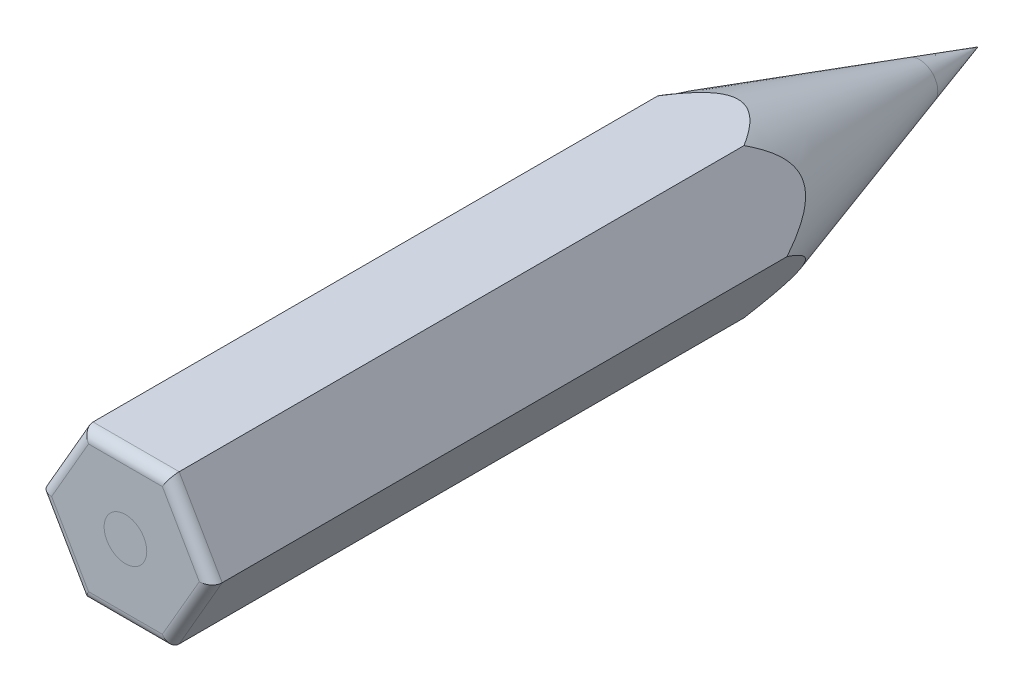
ISO-10303-21;
HEADER;
FILE_DESCRIPTION(('STEP AP214'),'2;1');
FILE_NAME('part.step','',(''),(''),'','','');
FILE_SCHEMA(('AUTOMOTIVE_DESIGN { 1 0 10303 214 1 1 1 1 }'));
ENDSEC;
DATA;
#1=APPLICATION_CONTEXT('core data for automotive mechanical design processes');
#2=APPLICATION_PROTOCOL_DEFINITION('international standard','automotive_design',2000,#1);
#3=PRODUCT_CONTEXT('',#1,'mechanical');
#4=PRODUCT('Part','Part','',(#3));
#5=PRODUCT_RELATED_PRODUCT_CATEGORY('part','',(#4));
#6=PRODUCT_DEFINITION_FORMATION('','',#4);
#7=PRODUCT_DEFINITION_CONTEXT('part definition',#1,'design');
#8=PRODUCT_DEFINITION('design','',#6,#7);
#9=PRODUCT_DEFINITION_SHAPE('','',#8);
#10=(LENGTH_UNIT() NAMED_UNIT(*) SI_UNIT(.MILLI.,.METRE.));
#11=(NAMED_UNIT(*) PLANE_ANGLE_UNIT() SI_UNIT($,.RADIAN.));
#12=(NAMED_UNIT(*) SI_UNIT($,.STERADIAN.) SOLID_ANGLE_UNIT());
#13=UNCERTAINTY_MEASURE_WITH_UNIT(LENGTH_MEASURE(1.E-05),#10,'distance_accuracy_value','');
#14=(GEOMETRIC_REPRESENTATION_CONTEXT(3) GLOBAL_UNCERTAINTY_ASSIGNED_CONTEXT((#13)) GLOBAL_UNIT_ASSIGNED_CONTEXT((#10,
#11,#12)) REPRESENTATION_CONTEXT('',''));
#15=CARTESIAN_POINT('',(0.,0.,0.));
#16=DIRECTION('',(0.,0.,1.));
#17=DIRECTION('',(1.,0.,0.));
#18=AXIS2_PLACEMENT_3D('',#15,#16,#17);
#19=CARTESIAN_POINT('',(0.,0.,0.));
#20=DIRECTION('',(0.,0.,1.));
#21=DIRECTION('',(1.,0.,0.));
#22=AXIS2_PLACEMENT_3D('',#19,#20,#21);
#23=CONICAL_SURFACE('',#22,0.,0.301409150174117);
#24=CARTESIAN_POINT('',(0.,0.,0.));
#25=VERTEX_POINT('',#24);
#26=VERTEX_LOOP('',#25);
#27=FACE_BOUND('',#26,.T.);
#28=CARTESIAN_POINT('',(0.,0.,2.73816623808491));
#29=DIRECTION('',(0.,0.,1.));
#30=DIRECTION('',(1.,0.,0.));
#31=AXIS2_PLACEMENT_3D('',#28,#29,#30);
#32=CIRCLE('',#31,0.85124362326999);
#33=CARTESIAN_POINT('',(0.85124362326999,0.,2.73816623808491));
#34=VERTEX_POINT('',#33);
#35=EDGE_CURVE('E158',#34,#34,#32,.T.);
#36=ORIENTED_EDGE('',*,*,#35,.F.);
#37=EDGE_LOOP('',(#36));
#38=FACE_BOUND('',#37,.T.);
#39=ADVANCED_FACE('F78',(#27,#38),#23,.T.);
#40=CARTESIAN_POINT('',(0.,0.,40.));
#41=DIRECTION('',(0.,0.,1.));
#42=DIRECTION('',(1.,0.,0.));
#43=AXIS2_PLACEMENT_3D('',#40,#41,#42);
#44=PLANE('',#43);
#45=DIRECTION('',(0.500000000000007,-0.866025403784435,0.));
#46=VECTOR('',#45,1.);
#47=CARTESIAN_POINT('',(-1.58771324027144,-3.25000000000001,40.));
#48=LINE('',#47,#46);
#49=CARTESIAN_POINT('',(-3.46410161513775,0.,40.));
#50=VERTEX_POINT('',#49);
#51=CARTESIAN_POINT('',(-1.73205080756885,-3.00000000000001,40.));
#52=VERTEX_POINT('',#51);
#53=EDGE_CURVE('E179',#50,#52,#48,.T.);
#54=ORIENTED_EDGE('',*,*,#53,.T.);
#55=DIRECTION('',(1.,0.,0.));
#56=VECTOR('',#55,1.);
#57=CARTESIAN_POINT('',(2.02072594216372,-2.99999999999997,40.));
#58=LINE('',#57,#56);
#59=CARTESIAN_POINT('',(1.73205080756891,-2.99999999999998,40.));
#60=VERTEX_POINT('',#59);
#61=EDGE_CURVE('E181',#52,#60,#58,.T.);
#62=ORIENTED_EDGE('',*,*,#61,.T.);
#63=DIRECTION('',(0.499999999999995,0.866025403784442,0.));
#64=VECTOR('',#63,1.);
#65=CARTESIAN_POINT('',(3.60843918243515,0.249999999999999,40.));
#66=LINE('',#65,#64);
#67=CARTESIAN_POINT('',(3.46410161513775,0.,40.));
#68=VERTEX_POINT('',#67);
#69=EDGE_CURVE('E161',#60,#68,#66,.T.);
#70=ORIENTED_EDGE('',*,*,#69,.T.);
#71=DIRECTION('',(-0.500000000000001,0.866025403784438,0.));
#72=VECTOR('',#71,1.);
#73=CARTESIAN_POINT('',(1.58771324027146,3.25,40.));
#74=LINE('',#73,#72);
#75=CARTESIAN_POINT('',(1.73205080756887,3.,40.));
#76=VERTEX_POINT('',#75);
#77=EDGE_CURVE('E167',#68,#76,#74,.T.);
#78=ORIENTED_EDGE('',*,*,#77,.T.);
#79=DIRECTION('',(-1.,0.,0.));
#80=VECTOR('',#79,1.);
#81=CARTESIAN_POINT('',(-2.0207259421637,2.99999999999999,40.));
#82=LINE('',#81,#80);
#83=CARTESIAN_POINT('',(-1.73205080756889,2.99999999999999,40.));
#84=VERTEX_POINT('',#83);
#85=EDGE_CURVE('E175',#76,#84,#82,.T.);
#86=ORIENTED_EDGE('',*,*,#85,.T.);
#87=DIRECTION('',(-0.499999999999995,-0.866025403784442,0.));
#88=VECTOR('',#87,1.);
#89=CARTESIAN_POINT('',(-3.60843918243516,-0.250000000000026,40.));
#90=LINE('',#89,#88);
#91=EDGE_CURVE('E177',#84,#50,#90,.T.);
#92=ORIENTED_EDGE('',*,*,#91,.T.);
#93=EDGE_LOOP('',(#54,#62,#70,#78,#86,#92));
#94=FACE_BOUND('',#93,.T.);
#95=CARTESIAN_POINT('',(0.,0.,40.));
#96=DIRECTION('',(0.,0.,1.));
#97=DIRECTION('',(1.,0.,0.));
#98=AXIS2_PLACEMENT_3D('',#95,#96,#97);
#99=CIRCLE('',#98,1.);
#100=CARTESIAN_POINT('',(1.,0.,40.));
#101=VERTEX_POINT('',#100);
#102=EDGE_CURVE('E162',#101,#101,#99,.F.);
#103=ORIENTED_EDGE('',*,*,#102,.T.);
#104=EDGE_LOOP('',(#103));
#105=FACE_BOUND('',#104,.T.);
#106=ADVANCED_FACE('F153',(#94,#105),#44,.T.);
#107=ORIENTED_EDGE('',*,*,#35,.T.);
#108=EDGE_LOOP('',(#107));
#109=FACE_BOUND('',#108,.T.);
#110=CARTESIAN_POINT('',(2.02061047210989,-3.50019999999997,13.0003714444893));
#111=CARTESIAN_POINT('',(2.03722946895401,-3.47141505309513,12.9469145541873));
#112=CARTESIAN_POINT('',(2.05406732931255,-3.44225102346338,12.8937306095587));
#113=CARTESIAN_POINT('',(2.0882417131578,-3.38305925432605,12.7879937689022));
#114=CARTESIAN_POINT('',(2.10557833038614,-3.35303135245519,12.7354409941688));
#115=CARTESIAN_POINT('',(2.15859521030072,-3.26120342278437,12.5783630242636));
#116=CARTESIAN_POINT('',(2.19511665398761,-3.1979464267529,12.4749574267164));
#117=CARTESIAN_POINT('',(2.27180037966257,-3.0651263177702,12.2702621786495));
#118=CARTESIAN_POINT('',(2.31202281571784,-2.99545901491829,12.1690619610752));
#119=CARTESIAN_POINT('',(2.39629081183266,-2.84950256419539,11.9734651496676));
#120=CARTESIAN_POINT('',(2.44032735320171,-2.77322903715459,11.8790534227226));
#121=CARTESIAN_POINT('',(2.51820192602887,-2.63834632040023,11.73032605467));
#122=CARTESIAN_POINT('',(2.55061417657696,-2.58220665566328,11.6730550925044));
#123=CARTESIAN_POINT('',(2.61822535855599,-2.4651006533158,11.565482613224));
#124=CARTESIAN_POINT('',(2.65342202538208,-2.40413823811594,11.5151755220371));
#125=CARTESIAN_POINT('',(2.72759365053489,-2.27566921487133,11.4239429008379));
#126=CARTESIAN_POINT('',(2.76661944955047,-2.20807454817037,11.3831778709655));
#127=CARTESIAN_POINT('',(2.84778395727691,-2.06749349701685,11.3170053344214));
#128=CARTESIAN_POINT('',(2.88990925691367,-1.99453033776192,11.2915355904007));
#129=CARTESIAN_POINT('',(2.96390554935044,-1.86636499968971,11.2648600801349));
#130=CARTESIAN_POINT('',(2.99534266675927,-1.81191431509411,11.258855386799));
#131=CARTESIAN_POINT('',(3.05827045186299,-1.7029201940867,11.25787252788));
#132=CARTESIAN_POINT('',(3.08976112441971,-1.64837674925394,11.2628954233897));
#133=CARTESIAN_POINT('',(3.15172794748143,-1.5410470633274,11.2832954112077));
#134=CARTESIAN_POINT('',(3.18220779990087,-1.48825441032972,11.2986289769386));
#135=CARTESIAN_POINT('',(3.2416996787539,-1.38521145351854,11.3379679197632));
#136=CARTESIAN_POINT('',(3.27071132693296,-1.33496180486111,11.3619755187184));
#137=CARTESIAN_POINT('',(3.34786894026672,-1.20132089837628,11.4370428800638));
#138=CARTESIAN_POINT('',(3.39432200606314,-1.12086182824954,11.4949869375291));
#139=CARTESIAN_POINT('',(3.48283944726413,-0.967545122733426,11.6240455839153));
#140=CARTESIAN_POINT('',(3.52485596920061,-0.894770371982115,11.6952845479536));
#141=CARTESIAN_POINT('',(3.61345862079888,-0.741306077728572,11.8616096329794));
#142=CARTESIAN_POINT('',(3.65915419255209,-0.662159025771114,11.95856329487));
#143=CARTESIAN_POINT('',(3.74645213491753,-0.510954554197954,12.1598244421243));
#144=CARTESIAN_POINT('',(3.78804383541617,-0.438915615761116,12.2641499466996));
#145=CARTESIAN_POINT('',(3.86621004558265,-0.303527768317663,12.472577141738));
#146=CARTESIAN_POINT('',(3.90292760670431,-0.23993108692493,12.5764662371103));
#147=CARTESIAN_POINT('',(3.95621180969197,-0.147640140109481,12.7342710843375));
#148=CARTESIAN_POINT('',(3.97362910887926,-0.117472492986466,12.7870535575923));
#149=CARTESIAN_POINT('',(4.00796025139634,-0.058009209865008,12.8932562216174));
#150=CARTESIAN_POINT('',(4.0248741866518,-0.0287134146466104,12.9466762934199));
#151=CARTESIAN_POINT('',(4.04156735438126,0.000200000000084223,13.0003714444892));
#152=B_SPLINE_CURVE_WITH_KNOTS('',3,(#110,#111,#112,#113,#114,#115,#116,#117,#118,#119,#120,
#121,#122,#123,#124,#125,#126,#127,#128,#129,#130,#131,#132,#133,#134,#135,#136,#137,#138,#139,
#140,#141,#142,#143,#144,#145,#146,#147,#148,#149,#150,#151),.UNSPECIFIED.,.F.,.F.,(4,2,2,2,2,2,
2,2,2,2,2,2,2,2,2,2,2,2,2,2,4),(0.,0.188837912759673,0.377711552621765,0.757356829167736,
1.14493911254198,1.53162872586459,1.79079874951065,2.04976011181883,2.3128062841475,
2.57477472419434,2.76334374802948,2.95193091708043,3.13972692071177,3.32757106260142,
3.65414724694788,3.98394746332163,4.38293624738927,4.78293648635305,5.16444572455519,
5.35416083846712,5.54384109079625),.UNSPECIFIED.);
#153=CARTESIAN_POINT('',(2.02072594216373,-3.49999999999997,13.));
#154=VERTEX_POINT('',#153);
#155=CARTESIAN_POINT('',(4.04145188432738,0.,13.));
#156=VERTEX_POINT('',#155);
#157=EDGE_CURVE('E242',#154,#156,#152,.T.);
#158=ORIENTED_EDGE('',*,*,#157,.F.);
#159=CARTESIAN_POINT('',(-12.326890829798,-3.50000000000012,41.2188124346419));
#160=CARTESIAN_POINT('',(-12.0741858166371,-3.50000000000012,40.4368939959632));
#161=CARTESIAN_POINT('',(-11.8209783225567,-3.50000000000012,39.6551374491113));
#162=CARTESIAN_POINT('',(-11.313288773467,-3.50000000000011,38.0920348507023));
#163=CARTESIAN_POINT('',(-11.0588067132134,-3.50000000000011,37.3106888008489));
#164=CARTESIAN_POINT('',(-10.5482451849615,-3.5000000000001,35.7483310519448));
#165=CARTESIAN_POINT('',(-10.2921653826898,-3.5000000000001,34.9673194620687));
#166=CARTESIAN_POINT('',(-9.77808417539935,-3.5000000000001,33.4059303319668));
#167=CARTESIAN_POINT('',(-9.52008277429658,-3.50000000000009,32.6255527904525));
#168=CARTESIAN_POINT('',(-9.0006166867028,-3.50000000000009,31.0625052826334));
#169=CARTESIAN_POINT('',(-8.73914231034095,-3.50000000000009,30.2798385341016));
#170=CARTESIAN_POINT('',(-8.21301658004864,-3.50000000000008,28.7155738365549));
#171=CARTESIAN_POINT('',(-7.94836523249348,-3.50000000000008,27.9339758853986));
#172=CARTESIAN_POINT('',(-7.41485804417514,-3.50000000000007,26.3723200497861));
#173=CARTESIAN_POINT('',(-7.14600271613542,-3.50000000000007,25.5922619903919));
#174=CARTESIAN_POINT('',(-6.60247055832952,-3.50000000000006,24.0341797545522));
#175=CARTESIAN_POINT('',(-6.32779380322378,-3.50000000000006,23.2561555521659));
#176=CARTESIAN_POINT('',(-5.83773374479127,-3.50000000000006,21.8917707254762));
#177=CARTESIAN_POINT('',(-5.6241556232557,-3.50000000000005,21.3047625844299));
#178=CARTESIAN_POINT('',(-5.19028824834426,-3.50000000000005,20.1331091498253));
#179=CARTESIAN_POINT('',(-4.96999792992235,-3.50000000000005,19.5484642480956));
#180=CARTESIAN_POINT('',(-4.63233695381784,-3.50000000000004,18.6744391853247));
#181=CARTESIAN_POINT('',(-4.51860577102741,-3.50000000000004,18.3836537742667));
#182=CARTESIAN_POINT('',(-4.28813108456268,-3.50000000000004,17.8032807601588));
#183=CARTESIAN_POINT('',(-4.17138762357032,-3.50000000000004,17.5136931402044));
#184=CARTESIAN_POINT('',(-3.93415637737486,-3.50000000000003,16.9361582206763));
#185=CARTESIAN_POINT('',(-3.8136697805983,-3.50000000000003,16.6482104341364));
#186=CARTESIAN_POINT('',(-3.56783386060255,-3.50000000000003,16.0744036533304));
#187=CARTESIAN_POINT('',(-3.44248478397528,-3.50000000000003,15.7885445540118));
#188=CARTESIAN_POINT('',(-3.20129524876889,-3.50000000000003,15.2551426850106));
#189=CARTESIAN_POINT('',(-3.08621247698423,-3.50000000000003,15.007258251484));
#190=CARTESIAN_POINT('',(-2.84936836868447,-3.50000000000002,14.5145005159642));
#191=CARTESIAN_POINT('',(-2.72760349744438,-3.50000000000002,14.2696288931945));
#192=CARTESIAN_POINT('',(-2.5378893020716,-3.50000000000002,13.9056453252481));
#193=CARTESIAN_POINT('',(-2.47339482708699,-3.50000000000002,13.7847337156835));
#194=CARTESIAN_POINT('',(-2.34159407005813,-3.50000000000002,13.5444567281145));
#195=CARTESIAN_POINT('',(-2.27428798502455,-3.50000000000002,13.4250912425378));
#196=CARTESIAN_POINT('',(-2.13629519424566,-3.50000000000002,13.1884677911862));
#197=CARTESIAN_POINT('',(-2.06561162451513,-3.50000000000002,13.0712080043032));
#198=CARTESIAN_POINT('',(-1.91996345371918,-3.50000000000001,12.8393910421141));
#199=CARTESIAN_POINT('',(-1.84499983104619,-3.50000000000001,12.7248332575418));
#200=CARTESIAN_POINT('',(-1.70388794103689,-3.50000000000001,12.5202433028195));
#201=CARTESIAN_POINT('',(-1.6386590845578,-3.50000000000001,12.4295801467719));
#202=CARTESIAN_POINT('',(-1.50356958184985,-3.50000000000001,12.2516180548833));
#203=CARTESIAN_POINT('',(-1.43370520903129,-3.50000000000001,12.1643219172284));
#204=CARTESIAN_POINT('',(-1.28862724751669,-3.50000000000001,11.995192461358));
#205=CARTESIAN_POINT('',(-1.2134500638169,-3.50000000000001,11.9133282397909));
#206=CARTESIAN_POINT('',(-1.05585086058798,-3.5,11.7569887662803));
#207=CARTESIAN_POINT('',(-0.973442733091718,-3.5,11.6824999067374));
#208=CARTESIAN_POINT('',(-0.823883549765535,-3.5,11.5644053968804));
#209=CARTESIAN_POINT('',(-0.75896496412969,-3.5,11.5180077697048));
#210=CARTESIAN_POINT('',(-0.623717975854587,-3.5,11.433711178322));
#211=CARTESIAN_POINT('',(-0.553392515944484,-3.5,11.3958076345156));
#212=CARTESIAN_POINT('',(-0.418337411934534,-3.5,11.3367446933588));
#213=CARTESIAN_POINT('',(-0.354348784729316,-3.5,11.313927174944));
#214=CARTESIAN_POINT('',(-0.223470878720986,-3.5,11.2793149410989));
#215=CARTESIAN_POINT('',(-0.156586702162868,-3.5,11.2675016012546));
#216=CARTESIAN_POINT('',(-0.0213573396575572,-3.49999999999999,11.2564329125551));
#217=CARTESIAN_POINT('',(0.0469940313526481,-3.49999999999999,11.2572500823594));
#218=CARTESIAN_POINT('',(0.182388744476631,-3.49999999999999,11.2714964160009));
#219=CARTESIAN_POINT('',(0.249430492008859,-3.49999999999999,11.2849400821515));
#220=CARTESIAN_POINT('',(0.394296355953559,-3.49999999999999,11.3266844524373));
#221=CARTESIAN_POINT('',(0.471364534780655,-3.49999999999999,11.3575453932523));
#222=CARTESIAN_POINT('',(0.619654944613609,-3.49999999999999,11.4309649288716));
#223=CARTESIAN_POINT('',(0.690865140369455,-3.49999999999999,11.4735468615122));
#224=CARTESIAN_POINT('',(0.82210484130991,-3.49999999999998,11.5630466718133));
#225=CARTESIAN_POINT('',(0.882572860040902,-3.49999999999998,11.6093368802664));
#226=CARTESIAN_POINT('',(0.999391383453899,-3.49999999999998,11.7068951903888));
#227=CARTESIAN_POINT('',(1.05573792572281,-3.49999999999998,11.7581679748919));
#228=CARTESIAN_POINT('',(1.1650688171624,-3.49999999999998,11.8645101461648));
#229=CARTESIAN_POINT('',(1.21804083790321,-3.49999999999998,11.9195920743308));
#230=CARTESIAN_POINT('',(1.32094040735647,-3.49999999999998,12.0324594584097));
#231=CARTESIAN_POINT('',(1.37086937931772,-3.49999999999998,12.0902436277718));
#232=CARTESIAN_POINT('',(1.51182796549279,-3.49999999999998,12.2606329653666));
#233=CARTESIAN_POINT('',(1.59957795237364,-3.49999999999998,12.3759455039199));
#234=CARTESIAN_POINT('',(1.76838927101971,-3.49999999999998,12.6113998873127));
#235=CARTESIAN_POINT('',(1.84944562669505,-3.49999999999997,12.7315452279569));
#236=CARTESIAN_POINT('',(2.0065755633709,-3.49999999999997,12.9754108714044));
#237=CARTESIAN_POINT('',(2.08263766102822,-3.49999999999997,13.0991385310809));
#238=CARTESIAN_POINT('',(2.23070583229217,-3.49999999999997,13.3490011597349));
#239=CARTESIAN_POINT('',(2.30271140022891,-3.49999999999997,13.4751364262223));
#240=CARTESIAN_POINT('',(2.44411165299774,-3.49999999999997,13.7303892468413));
#241=CARTESIAN_POINT('',(2.51347584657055,-3.49999999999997,13.859523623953));
#242=CARTESIAN_POINT('',(2.64948877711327,-3.49999999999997,14.1192202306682));
#243=CARTESIAN_POINT('',(2.7161373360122,-3.49999999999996,14.249782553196));
#244=CARTESIAN_POINT('',(2.84707039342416,-3.49999999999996,14.5118291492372));
#245=CARTESIAN_POINT('',(2.91135842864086,-3.49999999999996,14.6433116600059));
#246=CARTESIAN_POINT('',(3.03802698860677,-3.49999999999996,14.9071846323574));
#247=CARTESIAN_POINT('',(3.10040757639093,-3.49999999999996,15.0395750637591));
#248=CARTESIAN_POINT('',(3.28759879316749,-3.49999999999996,15.4432051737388));
#249=CARTESIAN_POINT('',(3.4098538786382,-3.49999999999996,15.7156303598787));
#250=CARTESIAN_POINT('',(3.64935035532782,-3.49999999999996,16.2626814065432));
#251=CARTESIAN_POINT('',(3.76659140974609,-3.49999999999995,16.5373074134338));
#252=CARTESIAN_POINT('',(3.99720537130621,-3.49999999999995,17.08824349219));
#253=CARTESIAN_POINT('',(4.11057745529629,-3.49999999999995,17.3645539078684));
#254=CARTESIAN_POINT('',(4.33422513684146,-3.49999999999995,17.9184269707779));
#255=CARTESIAN_POINT('',(4.44450067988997,-3.49999999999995,18.195989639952));
#256=CARTESIAN_POINT('',(4.771947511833,-3.49999999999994,19.0310437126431));
#257=CARTESIAN_POINT('',(4.9853688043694,-3.49999999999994,19.5900046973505));
#258=CARTESIAN_POINT('',(5.40532707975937,-3.49999999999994,20.7104096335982));
#259=CARTESIAN_POINT('',(5.61186491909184,-3.49999999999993,21.2718532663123));
#260=CARTESIAN_POINT('',(6.00468298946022,-3.49999999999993,22.3544983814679));
#261=CARTESIAN_POINT('',(6.19132310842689,-3.49999999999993,22.8755695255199));
#262=CARTESIAN_POINT('',(6.56132150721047,-3.49999999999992,23.9188968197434));
#263=CARTESIAN_POINT('',(6.74467965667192,-3.49999999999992,24.4411530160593));
#264=CARTESIAN_POINT('',(7.10830865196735,-3.49999999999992,25.4851149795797));
#265=CARTESIAN_POINT('',(7.28858664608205,-3.49999999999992,26.0068182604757));
#266=CARTESIAN_POINT('',(7.64704281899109,-3.49999999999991,27.0509140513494));
#267=CARTESIAN_POINT('',(7.82522111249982,-3.49999999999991,27.5733065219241));
#268=CARTESIAN_POINT('',(8.00259369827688,-3.49999999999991,28.0959701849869));
#269=B_SPLINE_CURVE_WITH_KNOTS('',3,(#159,#160,#161,#162,#163,#164,#165,#166,#167,#168,#169,
#170,#171,#172,#173,#174,#175,#176,#177,#178,#179,#180,#181,#182,#183,#184,#185,#186,#187,#188,
#189,#190,#191,#192,#193,#194,#195,#196,#197,#198,#199,#200,#201,#202,#203,#204,#205,#206,#207,
#208,#209,#210,#211,#212,#213,#214,#215,#216,#217,#218,#219,#220,#221,#222,#223,#224,#225,#226,
#227,#228,#229,#230,#231,#232,#233,#234,#235,#236,#237,#238,#239,#240,#241,#242,#243,#244,#245,
#246,#247,#248,#249,#250,#251,#252,#253,#254,#255,#256,#257,#258,#259,#260,#261,#262,#263,#264,
#265,#266,#267,#268),.UNSPECIFIED.,.F.,.F.,(4,2,2,2,2,2,2,2,2,2,2,2,2,2,2,2,2,2,2,2,2,2,2,2,2,2,
2,2,2,2,2,2,2,2,2,2,2,2,2,2,2,2,2,2,2,2,2,2,2,2,2,2,2,2,4),(0.,2.46521989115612,
4.93044993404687,7.39621430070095,9.86197364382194,12.3375341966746,14.8130897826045,
17.2883457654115,19.7635700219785,21.637511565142,23.5117520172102,24.4484456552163,
25.3851260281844,26.3215119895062,27.2578505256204,28.077676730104,28.8979408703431,
29.3090236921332,29.720077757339,30.1307573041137,30.5413433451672,30.8763057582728,
31.2115407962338,31.5446675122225,31.8771676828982,32.1160997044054,32.3549025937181,
32.5579148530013,32.7605828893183,32.9644149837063,33.1684814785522,33.4161397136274,
33.6642946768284,33.8924137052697,34.1207492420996,34.349876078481,34.5788949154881,
35.0132188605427,35.4478628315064,35.8834735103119,36.3191383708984,36.7588529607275,
37.198596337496,37.6376514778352,38.0766920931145,38.9724128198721,39.8681936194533,
40.7641638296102,41.6601498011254,43.4550309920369,45.2496880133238,46.9101394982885,
48.5706567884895,50.2265717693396,51.8823958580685),.UNSPECIFIED.);
#270=CARTESIAN_POINT('',(-2.02072594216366,-3.50000000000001,13.));
#271=VERTEX_POINT('',#270);
#272=EDGE_CURVE('E170',#271,#154,#269,.T.);
#273=ORIENTED_EDGE('',*,*,#272,.F.);
#274=CARTESIAN_POINT('',(-4.04156735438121,0.000199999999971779,13.0003714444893));
#275=CARTESIAN_POINT('',(-4.02494835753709,-0.0285849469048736,12.9469145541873));
#276=CARTESIAN_POINT('',(-4.00811049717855,-0.0577489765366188,12.8937306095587));
#277=CARTESIAN_POINT('',(-3.9739361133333,-0.116940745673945,12.7879937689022));
#278=CARTESIAN_POINT('',(-3.95659949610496,-0.146968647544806,12.7354409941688));
#279=CARTESIAN_POINT('',(-3.90358261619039,-0.238796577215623,12.5783630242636));
#280=CARTESIAN_POINT('',(-3.86706117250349,-0.302053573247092,12.4749574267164));
#281=CARTESIAN_POINT('',(-3.79037744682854,-0.434873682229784,12.2702621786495));
#282=CARTESIAN_POINT('',(-3.75015501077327,-0.504540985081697,12.1690619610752));
#283=CARTESIAN_POINT('',(-3.66588701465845,-0.650497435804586,11.9734651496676));
#284=CARTESIAN_POINT('',(-3.6218504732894,-0.726770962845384,11.8790534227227));
#285=CARTESIAN_POINT('',(-3.54397590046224,-0.861653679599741,11.73032605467));
#286=CARTESIAN_POINT('',(-3.51156364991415,-0.91779334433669,11.6730550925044));
#287=CARTESIAN_POINT('',(-3.44395246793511,-1.03489934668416,11.565482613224));
#288=CARTESIAN_POINT('',(-3.40875580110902,-1.09586176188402,11.5151755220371));
#289=CARTESIAN_POINT('',(-3.33458417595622,-1.22433078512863,11.4239429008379));
#290=CARTESIAN_POINT('',(-3.29555837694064,-1.29192545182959,11.3831778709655));
#291=CARTESIAN_POINT('',(-3.21439386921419,-1.4325065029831,11.3170053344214));
#292=CARTESIAN_POINT('',(-3.17226856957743,-1.50546966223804,11.2915355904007));
#293=CARTESIAN_POINT('',(-3.09827227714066,-1.63363500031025,11.2648600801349));
#294=CARTESIAN_POINT('',(-3.06683515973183,-1.68808568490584,11.2588553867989));
#295=CARTESIAN_POINT('',(-3.00390737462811,-1.79707980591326,11.25787252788));
#296=CARTESIAN_POINT('',(-2.97241670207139,-1.85162325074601,11.2628954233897));
#297=CARTESIAN_POINT('',(-2.91044987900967,-1.95895293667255,11.2832954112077));
#298=CARTESIAN_POINT('',(-2.87997002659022,-2.01174558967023,11.2986289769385));
#299=CARTESIAN_POINT('',(-2.82047814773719,-2.11478854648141,11.3379679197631));
#300=CARTESIAN_POINT('',(-2.79146649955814,-2.16503819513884,11.3619755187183));
#301=CARTESIAN_POINT('',(-2.71430888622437,-2.29867910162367,11.4370428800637));
#302=CARTESIAN_POINT('',(-2.66785582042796,-2.3791381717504,11.494986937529));
#303=CARTESIAN_POINT('',(-2.57933837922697,-2.53245487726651,11.6240455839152));
#304=CARTESIAN_POINT('',(-2.53732185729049,-2.60522962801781,11.6952845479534));
#305=CARTESIAN_POINT('',(-2.44871920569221,-2.75869392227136,11.8616096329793));
#306=CARTESIAN_POINT('',(-2.403023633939,-2.83784097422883,11.9585632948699));
#307=CARTESIAN_POINT('',(-2.31572569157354,-2.98904544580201,12.1598244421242));
#308=CARTESIAN_POINT('',(-2.27413399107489,-3.06108438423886,12.2641499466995));
#309=CARTESIAN_POINT('',(-2.1959677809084,-3.19647223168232,12.472577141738));
#310=CARTESIAN_POINT('',(-2.15925021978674,-3.26006891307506,12.5764662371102));
#311=CARTESIAN_POINT('',(-2.10596601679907,-3.35235985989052,12.7342710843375));
#312=CARTESIAN_POINT('',(-2.08854871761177,-3.38252750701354,12.7870535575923));
#313=CARTESIAN_POINT('',(-2.0542175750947,-3.44199079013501,12.8932562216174));
#314=CARTESIAN_POINT('',(-2.03730363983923,-3.4712865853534,12.9466762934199));
#315=CARTESIAN_POINT('',(-2.02061047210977,-3.5002000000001,13.0003714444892));
#316=B_SPLINE_CURVE_WITH_KNOTS('',3,(#274,#275,#276,#277,#278,#279,#280,#281,#282,#283,#284,
#285,#286,#287,#288,#289,#290,#291,#292,#293,#294,#295,#296,#297,#298,#299,#300,#301,#302,#303,
#304,#305,#306,#307,#308,#309,#310,#311,#312,#313,#314,#315),.UNSPECIFIED.,.F.,.F.,(4,2,2,2,2,2,
2,2,2,2,2,2,2,2,2,2,2,2,2,2,4),(0.,0.188837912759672,0.377711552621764,0.757356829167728,
1.14493911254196,1.53162872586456,1.79079874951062,2.04976011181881,2.31280628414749,
2.57477472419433,2.76334374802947,2.95193091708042,3.13972692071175,3.3275710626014,
3.65414724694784,3.98394746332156,4.38293624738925,4.78293648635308,5.16444572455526,
5.3541608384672,5.54384109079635),.UNSPECIFIED.);
#317=CARTESIAN_POINT('',(-4.04145188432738,0.,13.));
#318=VERTEX_POINT('',#317);
#319=EDGE_CURVE('E208',#318,#271,#316,.T.);
#320=ORIENTED_EDGE('',*,*,#319,.F.);
#321=CARTESIAN_POINT('',(-2.02061047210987,3.50019999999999,13.0003714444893));
#322=CARTESIAN_POINT('',(-2.03722946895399,3.47141505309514,12.9469145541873));
#323=CARTESIAN_POINT('',(-2.05406732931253,3.4422510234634,12.8937306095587));
#324=CARTESIAN_POINT('',(-2.08824171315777,3.38305925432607,12.7879937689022));
#325=CARTESIAN_POINT('',(-2.10557833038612,3.35303135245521,12.7354409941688));
#326=CARTESIAN_POINT('',(-2.15859521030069,3.26120342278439,12.5783630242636));
#327=CARTESIAN_POINT('',(-2.19511665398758,3.19794642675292,12.4749574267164));
#328=CARTESIAN_POINT('',(-2.27180037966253,3.06512631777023,12.2702621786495));
#329=CARTESIAN_POINT('',(-2.3120228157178,2.99545901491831,12.1690619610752));
#330=CARTESIAN_POINT('',(-2.39629081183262,2.84950256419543,11.9734651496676));
#331=CARTESIAN_POINT('',(-2.44032735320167,2.77322903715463,11.8790534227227));
#332=CARTESIAN_POINT('',(-2.51820192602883,2.63834632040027,11.73032605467));
#333=CARTESIAN_POINT('',(-2.55061417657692,2.58220665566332,11.6730550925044));
#334=CARTESIAN_POINT('',(-2.61822535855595,2.46510065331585,11.565482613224));
#335=CARTESIAN_POINT('',(-2.65342202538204,2.40413823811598,11.5151755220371));
#336=CARTESIAN_POINT('',(-2.72759365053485,2.27566921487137,11.4239429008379));
#337=CARTESIAN_POINT('',(-2.76661944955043,2.20807454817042,11.3831778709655));
#338=CARTESIAN_POINT('',(-2.84778395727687,2.0674934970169,11.3170053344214));
#339=CARTESIAN_POINT('',(-2.88990925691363,1.99453033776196,11.2915355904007));
#340=CARTESIAN_POINT('',(-2.9639055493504,1.86636499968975,11.2648600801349));
#341=CARTESIAN_POINT('',(-2.99534266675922,1.81191431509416,11.2588553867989));
#342=CARTESIAN_POINT('',(-3.05827045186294,1.70292019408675,11.25787252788));
#343=CARTESIAN_POINT('',(-3.08976112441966,1.64837674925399,11.2628954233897));
#344=CARTESIAN_POINT('',(-3.15172794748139,1.54104706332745,11.2832954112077));
#345=CARTESIAN_POINT('',(-3.18220779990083,1.48825441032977,11.2986289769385));
#346=CARTESIAN_POINT('',(-3.24169967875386,1.38521145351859,11.3379679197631));
#347=CARTESIAN_POINT('',(-3.27071132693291,1.33496180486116,11.3619755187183));
#348=CARTESIAN_POINT('',(-3.34786894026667,1.20132089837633,11.4370428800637));
#349=CARTESIAN_POINT('',(-3.39432200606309,1.12086182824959,11.494986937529));
#350=CARTESIAN_POINT('',(-3.48283944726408,0.967545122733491,11.6240455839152));
#351=CARTESIAN_POINT('',(-3.52485596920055,0.894770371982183,11.6952845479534));
#352=CARTESIAN_POINT('',(-3.61345862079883,0.741306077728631,11.8616096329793));
#353=CARTESIAN_POINT('',(-3.65915419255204,0.662159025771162,11.9585632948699));
#354=CARTESIAN_POINT('',(-3.74645213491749,0.510954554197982,12.1598244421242));
#355=CARTESIAN_POINT('',(-3.78804383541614,0.438915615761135,12.2641499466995));
#356=CARTESIAN_POINT('',(-3.86621004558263,0.303527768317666,12.472577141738));
#357=CARTESIAN_POINT('',(-3.9029276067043,0.239931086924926,12.5764662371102));
#358=CARTESIAN_POINT('',(-3.95621180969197,0.147640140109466,12.7342710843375));
#359=CARTESIAN_POINT('',(-3.97362910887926,0.117472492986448,12.7870535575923));
#360=CARTESIAN_POINT('',(-4.00796025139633,0.058009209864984,12.8932562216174));
#361=CARTESIAN_POINT('',(-4.0248741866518,0.028713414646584,12.9466762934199));
#362=CARTESIAN_POINT('',(-4.04156735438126,-0.000200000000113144,13.0003714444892));
#363=B_SPLINE_CURVE_WITH_KNOTS('',3,(#321,#322,#323,#324,#325,#326,#327,#328,#329,#330,#331,
#332,#333,#334,#335,#336,#337,#338,#339,#340,#341,#342,#343,#344,#345,#346,#347,#348,#349,#350,
#351,#352,#353,#354,#355,#356,#357,#358,#359,#360,#361,#362),.UNSPECIFIED.,.F.,.F.,(4,2,2,2,2,2,
2,2,2,2,2,2,2,2,2,2,2,2,2,2,4),(0.,0.188837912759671,0.37771155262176,0.757356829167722,
1.14493911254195,1.53162872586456,1.79079874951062,2.04976011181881,2.31280628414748,
2.57477472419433,2.76334374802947,2.95193091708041,3.13972692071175,3.3275710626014,
3.65414724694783,3.98394746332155,4.38293624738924,4.78293648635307,5.16444572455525,
5.3541608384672,5.54384109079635),.UNSPECIFIED.);
#364=CARTESIAN_POINT('',(-2.0207259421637,3.49999999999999,13.));
#365=VERTEX_POINT('',#364);
#366=EDGE_CURVE('E214',#365,#318,#363,.T.);
#367=ORIENTED_EDGE('',*,*,#366,.F.);
#368=CARTESIAN_POINT('',(-12.326890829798,3.49999999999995,41.218812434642));
#369=CARTESIAN_POINT('',(-12.0741858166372,3.49999999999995,40.4368939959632));
#370=CARTESIAN_POINT('',(-11.8209783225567,3.49999999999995,39.6551374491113));
#371=CARTESIAN_POINT('',(-11.313288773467,3.49999999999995,38.0920348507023));
#372=CARTESIAN_POINT('',(-11.0588067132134,3.49999999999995,37.3106888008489));
#373=CARTESIAN_POINT('',(-10.5482451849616,3.49999999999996,35.7483310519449));
#374=CARTESIAN_POINT('',(-10.2921653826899,3.49999999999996,34.9673194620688));
#375=CARTESIAN_POINT('',(-9.77808417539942,3.49999999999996,33.4059303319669));
#376=CARTESIAN_POINT('',(-9.52008277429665,3.49999999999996,32.6255527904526));
#377=CARTESIAN_POINT('',(-9.00061668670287,3.49999999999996,31.0625052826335));
#378=CARTESIAN_POINT('',(-8.73914231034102,3.49999999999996,30.2798385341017));
#379=CARTESIAN_POINT('',(-8.21301658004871,3.49999999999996,28.7155738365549));
#380=CARTESIAN_POINT('',(-7.94836523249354,3.49999999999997,27.9339758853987));
#381=CARTESIAN_POINT('',(-7.41485804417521,3.49999999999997,26.3723200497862));
#382=CARTESIAN_POINT('',(-7.14600271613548,3.49999999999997,25.5922619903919));
#383=CARTESIAN_POINT('',(-6.60247055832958,3.49999999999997,24.0341797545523));
#384=CARTESIAN_POINT('',(-6.32779380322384,3.49999999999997,23.256155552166));
#385=CARTESIAN_POINT('',(-5.83773374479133,3.49999999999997,21.8917707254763));
#386=CARTESIAN_POINT('',(-5.62415562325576,3.49999999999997,21.3047625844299));
#387=CARTESIAN_POINT('',(-5.19028824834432,3.49999999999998,20.1331091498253));
#388=CARTESIAN_POINT('',(-4.96999792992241,3.49999999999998,19.5484642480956));
#389=CARTESIAN_POINT('',(-4.6323369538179,3.49999999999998,18.6744391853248));
#390=CARTESIAN_POINT('',(-4.51860577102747,3.49999999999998,18.3836537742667));
#391=CARTESIAN_POINT('',(-4.28813108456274,3.49999999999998,17.8032807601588));
#392=CARTESIAN_POINT('',(-4.17138762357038,3.49999999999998,17.5136931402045));
#393=CARTESIAN_POINT('',(-3.93415637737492,3.49999999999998,16.9361582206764));
#394=CARTESIAN_POINT('',(-3.81366978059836,3.49999999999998,16.6482104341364));
#395=CARTESIAN_POINT('',(-3.56783386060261,3.49999999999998,16.0744036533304));
#396=CARTESIAN_POINT('',(-3.44248478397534,3.49999999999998,15.7885445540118));
#397=CARTESIAN_POINT('',(-3.20129524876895,3.49999999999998,15.2551426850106));
#398=CARTESIAN_POINT('',(-3.08621247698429,3.49999999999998,15.0072582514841));
#399=CARTESIAN_POINT('',(-2.84936836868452,3.49999999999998,14.5145005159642));
#400=CARTESIAN_POINT('',(-2.72760349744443,3.49999999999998,14.2696288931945));
#401=CARTESIAN_POINT('',(-2.53788930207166,3.49999999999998,13.9056453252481));
#402=CARTESIAN_POINT('',(-2.47339482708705,3.49999999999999,13.7847337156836));
#403=CARTESIAN_POINT('',(-2.34159407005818,3.49999999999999,13.5444567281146));
#404=CARTESIAN_POINT('',(-2.27428798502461,3.49999999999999,13.4250912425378));
#405=CARTESIAN_POINT('',(-2.13629519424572,3.49999999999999,13.1884677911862));
#406=CARTESIAN_POINT('',(-2.06561162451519,3.49999999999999,13.0712080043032));
#407=CARTESIAN_POINT('',(-1.91996345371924,3.49999999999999,12.8393910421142));
#408=CARTESIAN_POINT('',(-1.84499983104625,3.49999999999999,12.7248332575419));
#409=CARTESIAN_POINT('',(-1.70388794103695,3.49999999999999,12.5202433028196));
#410=CARTESIAN_POINT('',(-1.63865908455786,3.49999999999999,12.4295801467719));
#411=CARTESIAN_POINT('',(-1.50356958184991,3.49999999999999,12.2516180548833));
#412=CARTESIAN_POINT('',(-1.43370520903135,3.49999999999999,12.1643219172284));
#413=CARTESIAN_POINT('',(-1.28862724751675,3.49999999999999,11.995192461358));
#414=CARTESIAN_POINT('',(-1.21345006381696,3.49999999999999,11.9133282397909));
#415=CARTESIAN_POINT('',(-1.05585086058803,3.49999999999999,11.7569887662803));
#416=CARTESIAN_POINT('',(-0.973442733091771,3.49999999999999,11.6824999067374));
#417=CARTESIAN_POINT('',(-0.823883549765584,3.49999999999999,11.5644053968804));
#418=CARTESIAN_POINT('',(-0.75896496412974,3.49999999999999,11.5180077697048));
#419=CARTESIAN_POINT('',(-0.623717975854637,3.49999999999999,11.433711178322));
#420=CARTESIAN_POINT('',(-0.553392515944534,3.49999999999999,11.3958076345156));
#421=CARTESIAN_POINT('',(-0.418337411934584,3.49999999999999,11.3367446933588));
#422=CARTESIAN_POINT('',(-0.354348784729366,3.49999999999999,11.313927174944));
#423=CARTESIAN_POINT('',(-0.223470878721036,3.49999999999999,11.2793149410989));
#424=CARTESIAN_POINT('',(-0.156586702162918,3.49999999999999,11.2675016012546));
#425=CARTESIAN_POINT('',(-0.0213573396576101,3.49999999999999,11.2564329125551));
#426=CARTESIAN_POINT('',(0.0469940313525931,3.49999999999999,11.2572500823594));
#427=CARTESIAN_POINT('',(0.182388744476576,3.49999999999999,11.2714964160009));
#428=CARTESIAN_POINT('',(0.249430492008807,3.49999999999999,11.2849400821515));
#429=CARTESIAN_POINT('',(0.394296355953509,3.5,11.3266844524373));
#430=CARTESIAN_POINT('',(0.471364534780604,3.5,11.3575453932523));
#431=CARTESIAN_POINT('',(0.619654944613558,3.5,11.4309649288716));
#432=CARTESIAN_POINT('',(0.690865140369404,3.5,11.4735468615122));
#433=CARTESIAN_POINT('',(0.822104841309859,3.5,11.5630466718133));
#434=CARTESIAN_POINT('',(0.882572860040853,3.5,11.6093368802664));
#435=CARTESIAN_POINT('',(0.999391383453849,3.5,11.7068951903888));
#436=CARTESIAN_POINT('',(1.05573792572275,3.5,11.7581679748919));
#437=CARTESIAN_POINT('',(1.16506881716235,3.5,11.8645101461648));
#438=CARTESIAN_POINT('',(1.21804083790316,3.5,11.9195920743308));
#439=CARTESIAN_POINT('',(1.32094040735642,3.5,12.0324594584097));
#440=CARTESIAN_POINT('',(1.37086937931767,3.5,12.0902436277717));
#441=CARTESIAN_POINT('',(1.51182796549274,3.5,12.2606329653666));
#442=CARTESIAN_POINT('',(1.59957795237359,3.5,12.3759455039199));
#443=CARTESIAN_POINT('',(1.76838927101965,3.5,12.6113998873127));
#444=CARTESIAN_POINT('',(1.849445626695,3.5,12.7315452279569));
#445=CARTESIAN_POINT('',(2.00657556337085,3.5,12.9754108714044));
#446=CARTESIAN_POINT('',(2.08263766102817,3.5,13.0991385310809));
#447=CARTESIAN_POINT('',(2.23070583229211,3.5,13.3490011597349));
#448=CARTESIAN_POINT('',(2.30271140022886,3.5,13.4751364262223));
#449=CARTESIAN_POINT('',(2.44411165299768,3.5,13.7303892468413));
#450=CARTESIAN_POINT('',(2.51347584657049,3.5,13.859523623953));
#451=CARTESIAN_POINT('',(2.64948877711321,3.5,14.1192202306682));
#452=CARTESIAN_POINT('',(2.71613733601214,3.5,14.2497825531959));
#453=CARTESIAN_POINT('',(2.8470703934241,3.5,14.5118291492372));
#454=CARTESIAN_POINT('',(2.9113584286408,3.5,14.6433116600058));
#455=CARTESIAN_POINT('',(3.03802698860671,3.5,14.9071846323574));
#456=CARTESIAN_POINT('',(3.10040757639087,3.5,15.039575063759));
#457=CARTESIAN_POINT('',(3.28759879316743,3.50000000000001,15.4432051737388));
#458=CARTESIAN_POINT('',(3.40985387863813,3.50000000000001,15.7156303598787));
#459=CARTESIAN_POINT('',(3.64935035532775,3.50000000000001,16.2626814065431));
#460=CARTESIAN_POINT('',(3.76659140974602,3.50000000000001,16.5373074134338));
#461=CARTESIAN_POINT('',(3.99720537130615,3.50000000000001,17.08824349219));
#462=CARTESIAN_POINT('',(4.11057745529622,3.50000000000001,17.3645539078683));
#463=CARTESIAN_POINT('',(4.33422513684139,3.50000000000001,17.9184269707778));
#464=CARTESIAN_POINT('',(4.4445006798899,3.50000000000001,18.1959896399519));
#465=CARTESIAN_POINT('',(4.77194751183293,3.50000000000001,19.031043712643));
#466=CARTESIAN_POINT('',(4.98536880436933,3.50000000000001,19.5900046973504));
#467=CARTESIAN_POINT('',(5.4053270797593,3.50000000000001,20.7104096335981));
#468=CARTESIAN_POINT('',(5.61186491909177,3.50000000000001,21.2718532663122));
#469=CARTESIAN_POINT('',(6.00468298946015,3.50000000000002,22.3544983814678));
#470=CARTESIAN_POINT('',(6.19132310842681,3.50000000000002,22.8755695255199));
#471=CARTESIAN_POINT('',(6.56132150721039,3.50000000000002,23.9188968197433));
#472=CARTESIAN_POINT('',(6.74467965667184,3.50000000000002,24.4411530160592));
#473=CARTESIAN_POINT('',(7.10830865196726,3.50000000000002,25.4851149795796));
#474=CARTESIAN_POINT('',(7.28858664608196,3.50000000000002,26.0068182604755));
#475=CARTESIAN_POINT('',(7.647042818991,3.50000000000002,27.0509140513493));
#476=CARTESIAN_POINT('',(7.82522111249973,3.50000000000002,27.573306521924));
#477=CARTESIAN_POINT('',(8.00259369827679,3.50000000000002,28.0959701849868));
#478=B_SPLINE_CURVE_WITH_KNOTS('',3,(#368,#369,#370,#371,#372,#373,#374,#375,#376,#377,#378,
#379,#380,#381,#382,#383,#384,#385,#386,#387,#388,#389,#390,#391,#392,#393,#394,#395,#396,#397,
#398,#399,#400,#401,#402,#403,#404,#405,#406,#407,#408,#409,#410,#411,#412,#413,#414,#415,#416,
#417,#418,#419,#420,#421,#422,#423,#424,#425,#426,#427,#428,#429,#430,#431,#432,#433,#434,#435,
#436,#437,#438,#439,#440,#441,#442,#443,#444,#445,#446,#447,#448,#449,#450,#451,#452,#453,#454,
#455,#456,#457,#458,#459,#460,#461,#462,#463,#464,#465,#466,#467,#468,#469,#470,#471,#472,#473,
#474,#475,#476,#477),.UNSPECIFIED.,.F.,.F.,(4,2,2,2,2,2,2,2,2,2,2,2,2,2,2,2,2,2,2,2,2,2,2,2,2,2,
2,2,2,2,2,2,2,2,2,2,2,2,2,2,2,2,2,2,2,2,2,2,2,2,2,2,2,2,4),(0.,2.46521989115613,
4.93044993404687,7.39621430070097,9.86197364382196,12.3375341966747,14.8130897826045,
17.2883457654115,19.7635700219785,21.637511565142,23.5117520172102,24.4484456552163,
25.3851260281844,26.3215119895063,27.2578505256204,28.0776767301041,28.8979408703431,
29.3090236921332,29.7200777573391,30.1307573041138,30.5413433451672,30.8763057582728,
31.2115407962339,31.5446675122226,31.8771676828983,32.1160997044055,32.3549025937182,
32.5579148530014,32.7605828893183,32.9644149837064,33.1684814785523,33.4161397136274,
33.6642946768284,33.8924137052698,34.1207492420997,34.3498760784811,34.5788949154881,
35.0132188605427,35.4478628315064,35.8834735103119,36.3191383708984,36.7588529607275,
37.198596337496,37.6376514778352,38.0766920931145,38.9724128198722,39.8681936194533,
40.7641638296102,41.6601498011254,43.4550309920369,45.2496880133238,46.9101394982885,
48.5706567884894,50.2265717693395,51.8823958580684),.UNSPECIFIED.);
#479=CARTESIAN_POINT('',(2.02072594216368,3.5,13.));
#480=VERTEX_POINT('',#479);
#481=EDGE_CURVE('E220',#480,#365,#478,.F.);
#482=ORIENTED_EDGE('',*,*,#481,.F.);
#483=CARTESIAN_POINT('',(4.04156735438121,-0.0002,13.0003714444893));
#484=CARTESIAN_POINT('',(4.02494835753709,0.0285849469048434,12.9469145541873));
#485=CARTESIAN_POINT('',(4.00811049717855,0.0577489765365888,12.8937306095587));
#486=CARTESIAN_POINT('',(3.9739361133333,0.116940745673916,12.7879937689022));
#487=CARTESIAN_POINT('',(3.95659949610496,0.146968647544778,12.7354409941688));
#488=CARTESIAN_POINT('',(3.90358261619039,0.238796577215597,12.5783630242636));
#489=CARTESIAN_POINT('',(3.86706117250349,0.302053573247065,12.4749574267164));
#490=CARTESIAN_POINT('',(3.79037744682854,0.434873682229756,12.2702621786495));
#491=CARTESIAN_POINT('',(3.75015501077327,0.50454098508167,12.1690619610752));
#492=CARTESIAN_POINT('',(3.66588701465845,0.650497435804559,11.9734651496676));
#493=CARTESIAN_POINT('',(3.6218504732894,0.726770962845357,11.8790534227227));
#494=CARTESIAN_POINT('',(3.54397590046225,0.861653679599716,11.73032605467));
#495=CARTESIAN_POINT('',(3.51156364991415,0.917793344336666,11.6730550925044));
#496=CARTESIAN_POINT('',(3.44395246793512,1.03489934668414,11.565482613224));
#497=CARTESIAN_POINT('',(3.40875580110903,1.095861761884,11.5151755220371));
#498=CARTESIAN_POINT('',(3.33458417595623,1.22433078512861,11.4239429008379));
#499=CARTESIAN_POINT('',(3.29555837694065,1.29192545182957,11.3831778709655));
#500=CARTESIAN_POINT('',(3.2143938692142,1.43250650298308,11.3170053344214));
#501=CARTESIAN_POINT('',(3.17226856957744,1.50546966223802,11.2915355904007));
#502=CARTESIAN_POINT('',(3.09827227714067,1.63363500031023,11.2648600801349));
#503=CARTESIAN_POINT('',(3.06683515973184,1.68808568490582,11.2588553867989));
#504=CARTESIAN_POINT('',(3.00390737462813,1.79707980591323,11.25787252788));
#505=CARTESIAN_POINT('',(2.97241670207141,1.85162325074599,11.2628954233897));
#506=CARTESIAN_POINT('',(2.91044987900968,1.95895293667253,11.2832954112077));
#507=CARTESIAN_POINT('',(2.87997002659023,2.01174558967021,11.2986289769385));
#508=CARTESIAN_POINT('',(2.8204781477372,2.11478854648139,11.3379679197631));
#509=CARTESIAN_POINT('',(2.79146649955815,2.16503819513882,11.3619755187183));
#510=CARTESIAN_POINT('',(2.71430888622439,2.29867910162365,11.4370428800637));
#511=CARTESIAN_POINT('',(2.66785582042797,2.37913817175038,11.494986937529));
#512=CARTESIAN_POINT('',(2.57933837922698,2.53245487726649,11.6240455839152));
#513=CARTESIAN_POINT('',(2.53732185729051,2.60522962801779,11.6952845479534));
#514=CARTESIAN_POINT('',(2.44871920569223,2.75869392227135,11.8616096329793));
#515=CARTESIAN_POINT('',(2.40302363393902,2.83784097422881,11.9585632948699));
#516=CARTESIAN_POINT('',(2.31572569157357,2.98904544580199,12.1598244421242));
#517=CARTESIAN_POINT('',(2.27413399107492,3.06108438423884,12.2641499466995));
#518=CARTESIAN_POINT('',(2.19596778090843,3.19647223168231,12.472577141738));
#519=CARTESIAN_POINT('',(2.15925021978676,3.26006891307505,12.5764662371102));
#520=CARTESIAN_POINT('',(2.10596601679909,3.35235985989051,12.7342710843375));
#521=CARTESIAN_POINT('',(2.0885487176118,3.38252750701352,12.7870535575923));
#522=CARTESIAN_POINT('',(2.05421757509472,3.44199079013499,12.8932562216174));
#523=CARTESIAN_POINT('',(2.03730363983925,3.47128658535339,12.9466762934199));
#524=CARTESIAN_POINT('',(2.02061047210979,3.50020000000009,13.0003714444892));
#525=B_SPLINE_CURVE_WITH_KNOTS('',3,(#483,#484,#485,#486,#487,#488,#489,#490,#491,#492,#493,
#494,#495,#496,#497,#498,#499,#500,#501,#502,#503,#504,#505,#506,#507,#508,#509,#510,#511,#512,
#513,#514,#515,#516,#517,#518,#519,#520,#521,#522,#523,#524),.UNSPECIFIED.,.F.,.F.,(4,2,2,2,2,2,
2,2,2,2,2,2,2,2,2,2,2,2,2,2,4),(0.,0.188837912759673,0.377711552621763,0.757356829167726,
1.14493911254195,1.53162872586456,1.79079874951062,2.04976011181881,2.31280628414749,
2.57477472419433,2.76334374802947,2.95193091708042,3.13972692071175,3.3275710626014,
3.65414724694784,3.98394746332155,4.38293624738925,4.78293648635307,5.16444572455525,
5.3541608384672,5.54384109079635),.UNSPECIFIED.);
#526=EDGE_CURVE('E261',#156,#480,#525,.T.);
#527=ORIENTED_EDGE('',*,*,#526,.F.);
#528=EDGE_LOOP('',(#158,#273,#320,#367,#482,#527));
#529=FACE_BOUND('',#528,.T.);
#530=ADVANCED_FACE('F155',(#109,#529),#23,.T.);
#531=CARTESIAN_POINT('',(2.02072594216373,-3.49999999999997,40.));
#532=DIRECTION('',(-0.866025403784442,0.499999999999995,0.));
#533=DIRECTION('',(-0.499999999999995,-0.866025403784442,0.));
#534=AXIS2_PLACEMENT_3D('',#531,#532,#533);
#535=PLANE('',#534);
#536=DIRECTION('',(0.,0.,-1.));
#537=VECTOR('',#536,1.);
#538=CARTESIAN_POINT('',(4.04145188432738,0.,40.));
#539=LINE('',#538,#537);
#540=CARTESIAN_POINT('',(4.04145188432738,0.,39.5));
#541=VERTEX_POINT('',#540);
#542=EDGE_CURVE('E312',#541,#156,#539,.T.);
#543=ORIENTED_EDGE('',*,*,#542,.F.);
#544=DIRECTION('',(0.499999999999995,0.866025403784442,0.));
#545=VECTOR('',#544,1.);
#546=CARTESIAN_POINT('',(2.02072594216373,-3.49999999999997,39.5));
#547=LINE('',#546,#545);
#548=CARTESIAN_POINT('',(2.02072594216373,-3.49999999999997,39.5));
#549=VERTEX_POINT('',#548);
#550=EDGE_CURVE('E47',#541,#549,#547,.F.);
#551=ORIENTED_EDGE('',*,*,#550,.T.);
#552=DIRECTION('',(0.,0.,-1.));
#553=VECTOR('',#552,1.);
#554=CARTESIAN_POINT('',(2.02072594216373,-3.49999999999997,40.));
#555=LINE('',#554,#553);
#556=EDGE_CURVE('E310',#549,#154,#555,.T.);
#557=ORIENTED_EDGE('',*,*,#556,.T.);
#558=ORIENTED_EDGE('',*,*,#157,.T.);
#559=EDGE_LOOP('',(#543,#551,#557,#558));
#560=FACE_BOUND('',#559,.T.);
#561=ADVANCED_FACE('F237',(#560),#535,.F.);
#562=CARTESIAN_POINT('',(4.04145188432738,0.,40.));
#563=DIRECTION('',(-0.866025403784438,-0.500000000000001,0.));
#564=DIRECTION('',(0.500000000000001,-0.866025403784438,0.));
#565=AXIS2_PLACEMENT_3D('',#562,#563,#564);
#566=PLANE('',#565);
#567=DIRECTION('',(0.,0.,-1.));
#568=VECTOR('',#567,1.);
#569=CARTESIAN_POINT('',(2.02072594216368,3.5,40.));
#570=LINE('',#569,#568);
#571=CARTESIAN_POINT('',(2.02072594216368,3.5,39.5));
#572=VERTEX_POINT('',#571);
#573=EDGE_CURVE('E453',#572,#480,#570,.T.);
#574=ORIENTED_EDGE('',*,*,#573,.F.);
#575=DIRECTION('',(-0.500000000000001,0.866025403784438,0.));
#576=VECTOR('',#575,1.);
#577=CARTESIAN_POINT('',(4.04145188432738,0.,39.5));
#578=LINE('',#577,#576);
#579=EDGE_CURVE('E87',#572,#541,#578,.F.);
#580=ORIENTED_EDGE('',*,*,#579,.T.);
#581=ORIENTED_EDGE('',*,*,#542,.T.);
#582=ORIENTED_EDGE('',*,*,#526,.T.);
#583=EDGE_LOOP('',(#574,#580,#581,#582));
#584=FACE_BOUND('',#583,.T.);
#585=ADVANCED_FACE('F270',(#584),#566,.F.);
#586=CARTESIAN_POINT('',(2.02072594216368,3.5,40.));
#587=DIRECTION('',(0.,-1.,0.));
#588=DIRECTION('',(1.,0.,0.));
#589=AXIS2_PLACEMENT_3D('',#586,#587,#588);
#590=PLANE('',#589);
#591=DIRECTION('',(0.,0.,-1.));
#592=VECTOR('',#591,1.);
#593=CARTESIAN_POINT('',(-2.0207259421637,3.49999999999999,40.));
#594=LINE('',#593,#592);
#595=CARTESIAN_POINT('',(-2.0207259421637,3.49999999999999,39.5));
#596=VERTEX_POINT('',#595);
#597=EDGE_CURVE('E327',#596,#365,#594,.T.);
#598=ORIENTED_EDGE('',*,*,#597,.F.);
#599=DIRECTION('',(-1.,0.,0.));
#600=VECTOR('',#599,1.);
#601=CARTESIAN_POINT('',(2.02072594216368,3.5,39.5));
#602=LINE('',#601,#600);
#603=EDGE_CURVE('E102',#596,#572,#602,.F.);
#604=ORIENTED_EDGE('',*,*,#603,.T.);
#605=ORIENTED_EDGE('',*,*,#573,.T.);
#606=ORIENTED_EDGE('',*,*,#481,.T.);
#607=EDGE_LOOP('',(#598,#604,#605,#606));
#608=FACE_BOUND('',#607,.T.);
#609=ADVANCED_FACE('F266',(#608),#590,.F.);
#610=CARTESIAN_POINT('',(-2.0207259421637,3.49999999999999,40.));
#611=DIRECTION('',(0.866025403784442,-0.499999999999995,0.));
#612=DIRECTION('',(0.499999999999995,0.866025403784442,0.));
#613=AXIS2_PLACEMENT_3D('',#610,#611,#612);
#614=PLANE('',#613);
#615=DIRECTION('',(0.,0.,-1.));
#616=VECTOR('',#615,1.);
#617=CARTESIAN_POINT('',(-4.04145188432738,0.,40.));
#618=LINE('',#617,#616);
#619=CARTESIAN_POINT('',(-4.04145188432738,0.,39.5));
#620=VERTEX_POINT('',#619);
#621=EDGE_CURVE('E324',#620,#318,#618,.T.);
#622=ORIENTED_EDGE('',*,*,#621,.F.);
#623=DIRECTION('',(-0.499999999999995,-0.866025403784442,0.));
#624=VECTOR('',#623,1.);
#625=CARTESIAN_POINT('',(-2.0207259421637,3.49999999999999,39.5));
#626=LINE('',#625,#624);
#627=EDGE_CURVE('E189',#620,#596,#626,.F.);
#628=ORIENTED_EDGE('',*,*,#627,.T.);
#629=ORIENTED_EDGE('',*,*,#597,.T.);
#630=ORIENTED_EDGE('',*,*,#366,.T.);
#631=EDGE_LOOP('',(#622,#628,#629,#630));
#632=FACE_BOUND('',#631,.T.);
#633=ADVANCED_FACE('F269',(#632),#614,.F.);
#634=CARTESIAN_POINT('',(-4.04145188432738,0.,40.));
#635=DIRECTION('',(0.866025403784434,0.500000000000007,0.));
#636=DIRECTION('',(-0.500000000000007,0.866025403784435,0.));
#637=AXIS2_PLACEMENT_3D('',#634,#635,#636);
#638=PLANE('',#637);
#639=DIRECTION('',(0.,0.,-1.));
#640=VECTOR('',#639,1.);
#641=CARTESIAN_POINT('',(-2.02072594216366,-3.50000000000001,40.));
#642=LINE('',#641,#640);
#643=CARTESIAN_POINT('',(-2.02072594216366,-3.50000000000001,39.5));
#644=VERTEX_POINT('',#643);
#645=EDGE_CURVE('E317',#644,#271,#642,.T.);
#646=ORIENTED_EDGE('',*,*,#645,.F.);
#647=DIRECTION('',(0.500000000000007,-0.866025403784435,0.));
#648=VECTOR('',#647,1.);
#649=CARTESIAN_POINT('',(-4.04145188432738,0.,39.5));
#650=LINE('',#649,#648);
#651=EDGE_CURVE('E187',#644,#620,#650,.F.);
#652=ORIENTED_EDGE('',*,*,#651,.T.);
#653=ORIENTED_EDGE('',*,*,#621,.T.);
#654=ORIENTED_EDGE('',*,*,#319,.T.);
#655=EDGE_LOOP('',(#646,#652,#653,#654));
#656=FACE_BOUND('',#655,.T.);
#657=ADVANCED_FACE('F231',(#656),#638,.F.);
#658=CARTESIAN_POINT('',(-2.02072594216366,-3.50000000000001,40.));
#659=DIRECTION('',(0.,1.,0.));
#660=DIRECTION('',(-1.,0.,0.));
#661=AXIS2_PLACEMENT_3D('',#658,#659,#660);
#662=PLANE('',#661);
#663=ORIENTED_EDGE('',*,*,#556,.F.);
#664=DIRECTION('',(1.,0.,0.));
#665=VECTOR('',#664,1.);
#666=CARTESIAN_POINT('',(-2.02072594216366,-3.50000000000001,39.5));
#667=LINE('',#666,#665);
#668=EDGE_CURVE('E184',#549,#644,#667,.F.);
#669=ORIENTED_EDGE('',*,*,#668,.T.);
#670=ORIENTED_EDGE('',*,*,#645,.T.);
#671=ORIENTED_EDGE('',*,*,#272,.T.);
#672=EDGE_LOOP('',(#663,#669,#670,#671));
#673=FACE_BOUND('',#672,.T.);
#674=ADVANCED_FACE('F301',(#673),#662,.F.);
#675=ORIENTED_EDGE('',*,*,#102,.F.);
#676=EDGE_LOOP('',(#675));
#677=FACE_BOUND('',#676,.T.);
#678=ADVANCED_FACE('F238',(#677),#44,.T.);
#679=CARTESIAN_POINT('',(0.,2.99999999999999,39.5));
#680=DIRECTION('',(1.,0.,0.));
#681=DIRECTION('',(0.,1.,0.));
#682=AXIS2_PLACEMENT_3D('',#679,#680,#681);
#683=CYLINDRICAL_SURFACE('',#682,0.5);
#684=CARTESIAN_POINT('',(1.73205080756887,3.,39.5));
#685=DIRECTION('',(0.86602540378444,-0.499999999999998,0.));
#686=DIRECTION('',(-0.499999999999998,-0.86602540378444,0.));
#687=AXIS2_PLACEMENT_3D('',#684,#685,#686);
#688=ELLIPSE('',#687,0.577350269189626,0.5);
#689=EDGE_CURVE('E202',#572,#76,#688,.T.);
#690=ORIENTED_EDGE('',*,*,#689,.F.);
#691=ORIENTED_EDGE('',*,*,#603,.F.);
#692=CARTESIAN_POINT('',(-1.73205080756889,2.99999999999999,39.5));
#693=DIRECTION('',(0.866025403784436,0.500000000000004,0.));
#694=DIRECTION('',(0.500000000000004,-0.866025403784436,0.));
#695=AXIS2_PLACEMENT_3D('',#692,#693,#694);
#696=ELLIPSE('',#695,0.577350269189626,0.5);
#697=EDGE_CURVE('E82',#84,#596,#696,.F.);
#698=ORIENTED_EDGE('',*,*,#697,.F.);
#699=ORIENTED_EDGE('',*,*,#85,.F.);
#700=EDGE_LOOP('',(#690,#691,#698,#699));
#701=FACE_BOUND('',#700,.T.);
#702=ADVANCED_FACE('F80',(#701),#683,.T.);
#703=CARTESIAN_POINT('',(-2.59807621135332,1.49999999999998,39.5));
#704=DIRECTION('',(0.499999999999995,0.866025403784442,0.));
#705=DIRECTION('',(-0.866025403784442,0.499999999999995,0.));
#706=AXIS2_PLACEMENT_3D('',#703,#704,#705);
#707=CYLINDRICAL_SURFACE('',#706,0.5);
#708=ORIENTED_EDGE('',*,*,#697,.T.);
#709=ORIENTED_EDGE('',*,*,#627,.F.);
#710=CARTESIAN_POINT('',(-3.46410161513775,0.,39.5));
#711=DIRECTION('',(0.,1.,0.));
#712=DIRECTION('',(1.,0.,0.));
#713=AXIS2_PLACEMENT_3D('',#710,#711,#712);
#714=ELLIPSE('',#713,0.577350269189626,0.5);
#715=EDGE_CURVE('E200',#50,#620,#714,.F.);
#716=ORIENTED_EDGE('',*,*,#715,.F.);
#717=ORIENTED_EDGE('',*,*,#91,.F.);
#718=EDGE_LOOP('',(#708,#709,#716,#717));
#719=FACE_BOUND('',#718,.T.);
#720=ADVANCED_FACE('F292',(#719),#707,.T.);
#721=CARTESIAN_POINT('',(2.59807621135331,1.5,39.5));
#722=DIRECTION('',(0.500000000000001,-0.866025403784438,0.));
#723=DIRECTION('',(0.866025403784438,0.500000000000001,0.));
#724=AXIS2_PLACEMENT_3D('',#721,#722,#723);
#725=CYLINDRICAL_SURFACE('',#724,0.5);
#726=ORIENTED_EDGE('',*,*,#689,.T.);
#727=ORIENTED_EDGE('',*,*,#77,.F.);
#728=CARTESIAN_POINT('',(3.46410161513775,0.,39.5));
#729=DIRECTION('',(0.,-1.,0.));
#730=DIRECTION('',(-1.,0.,0.));
#731=AXIS2_PLACEMENT_3D('',#728,#729,#730);
#732=ELLIPSE('',#731,0.577350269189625,0.5);
#733=EDGE_CURVE('E197',#541,#68,#732,.T.);
#734=ORIENTED_EDGE('',*,*,#733,.F.);
#735=ORIENTED_EDGE('',*,*,#579,.F.);
#736=EDGE_LOOP('',(#726,#727,#734,#735));
#737=FACE_BOUND('',#736,.T.);
#738=ADVANCED_FACE('F289',(#737),#725,.T.);
#739=CARTESIAN_POINT('',(-2.5980762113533,-1.50000000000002,39.5));
#740=DIRECTION('',(-0.500000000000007,0.866025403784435,0.));
#741=DIRECTION('',(-0.866025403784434,-0.500000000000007,0.));
#742=AXIS2_PLACEMENT_3D('',#739,#740,#741);
#743=CYLINDRICAL_SURFACE('',#742,0.5);
#744=ORIENTED_EDGE('',*,*,#715,.T.);
#745=ORIENTED_EDGE('',*,*,#651,.F.);
#746=CARTESIAN_POINT('',(-1.73205080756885,-3.00000000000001,39.5));
#747=DIRECTION('',(-0.866025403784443,0.499999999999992,0.));
#748=DIRECTION('',(0.499999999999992,0.866025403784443,0.));
#749=AXIS2_PLACEMENT_3D('',#746,#747,#748);
#750=ELLIPSE('',#749,0.577350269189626,0.5);
#751=EDGE_CURVE('E195',#52,#644,#750,.F.);
#752=ORIENTED_EDGE('',*,*,#751,.F.);
#753=ORIENTED_EDGE('',*,*,#53,.F.);
#754=EDGE_LOOP('',(#744,#745,#752,#753));
#755=FACE_BOUND('',#754,.T.);
#756=ADVANCED_FACE('F285',(#755),#743,.T.);
#757=CARTESIAN_POINT('',(2.59807621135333,-1.49999999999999,39.5));
#758=DIRECTION('',(-0.499999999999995,-0.866025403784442,0.));
#759=DIRECTION('',(0.866025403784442,-0.499999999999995,0.));
#760=AXIS2_PLACEMENT_3D('',#757,#758,#759);
#761=CYLINDRICAL_SURFACE('',#760,0.5);
#762=ORIENTED_EDGE('',*,*,#733,.T.);
#763=ORIENTED_EDGE('',*,*,#69,.F.);
#764=CARTESIAN_POINT('',(1.73205080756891,-2.99999999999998,39.5));
#765=DIRECTION('',(-0.866025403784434,-0.500000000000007,0.));
#766=DIRECTION('',(0.500000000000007,-0.866025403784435,0.));
#767=AXIS2_PLACEMENT_3D('',#764,#765,#766);
#768=ELLIPSE('',#767,0.577350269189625,0.5);
#769=EDGE_CURVE('E193',#549,#60,#768,.T.);
#770=ORIENTED_EDGE('',*,*,#769,.F.);
#771=ORIENTED_EDGE('',*,*,#550,.F.);
#772=EDGE_LOOP('',(#762,#763,#770,#771));
#773=FACE_BOUND('',#772,.T.);
#774=ADVANCED_FACE('F281',(#773),#761,.T.);
#775=CARTESIAN_POINT('',(0.,-2.99999999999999,39.5));
#776=DIRECTION('',(-1.,0.,0.));
#777=DIRECTION('',(0.,-1.,0.));
#778=AXIS2_PLACEMENT_3D('',#775,#776,#777);
#779=CYLINDRICAL_SURFACE('',#778,0.5);
#780=ORIENTED_EDGE('',*,*,#751,.T.);
#781=ORIENTED_EDGE('',*,*,#668,.F.);
#782=ORIENTED_EDGE('',*,*,#769,.T.);
#783=ORIENTED_EDGE('',*,*,#61,.F.);
#784=EDGE_LOOP('',(#780,#781,#782,#783));
#785=FACE_BOUND('',#784,.T.);
#786=ADVANCED_FACE('F278',(#785),#779,.T.);
#787=CLOSED_SHELL('',(#39,#106,#530,#561,#585,#609,#633,#657,#674,#678,#702,#720,#738,#756,#774,#786));
#788=MANIFOLD_SOLID_BREP('B6',#787);
#789=ADVANCED_BREP_SHAPE_REPRESENTATION('',(#18,#788),#14);
#790=SHAPE_DEFINITION_REPRESENTATION(#9,#789);
ENDSEC;
END-ISO-10303-21;
